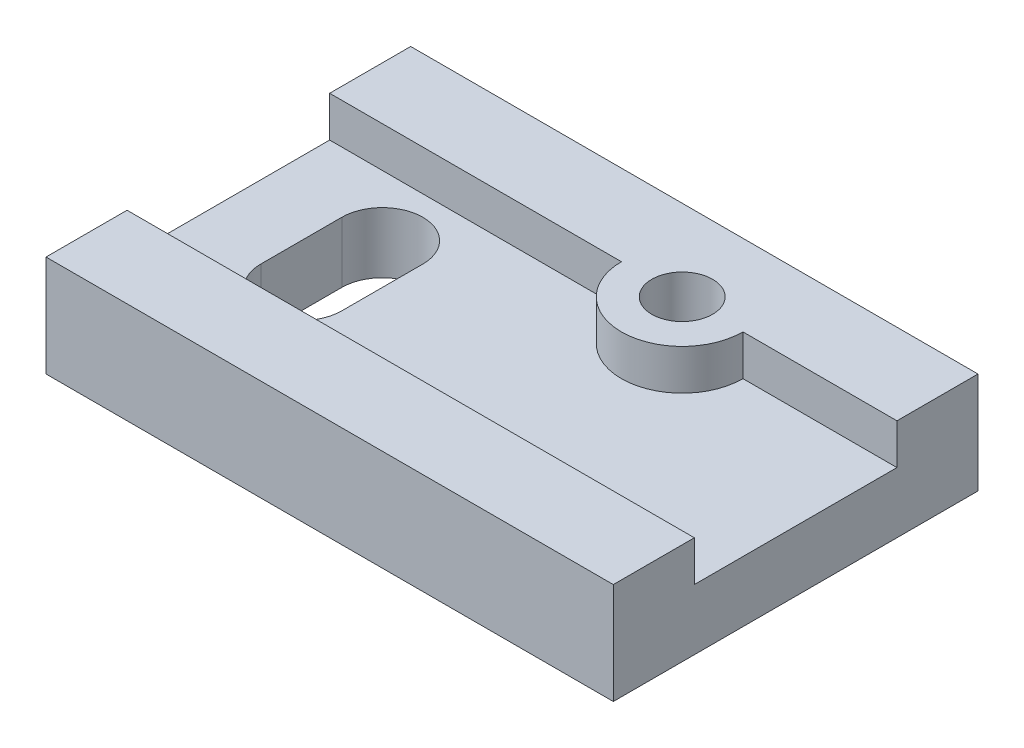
from build123d import *

# Parameters (mm, degrees)
SKETCH_1_W          = 140
SKETCH_1_H          = 90
EXTRUDE_1_DEPTH     = 25
CUT_EXTRUDE_1_DEPTH = 10
SKETCH_3_R          = 7.5
CUT_EXTRUDE_2_DEPTH = 169.300326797
CUT_EXTRUDE_3_DEPTH = 168.107749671


with BuildPart() as part:
    # Sketch 1 → Extrude 1 (new body)
    with BuildSketch(Plane(origin=(0, 0, 0), x_dir=(1, 0, 0), z_dir=(0, 1, 0))):
        with Locations((-70, -45)):
            Rectangle(SKETCH_1_W, SKETCH_1_H)
    extrude(amount=EXTRUDE_1_DEPTH)

    # Sketch 2 → Cut-Extrude 1 (cut)
    with BuildSketch(Plane(origin=(0, 25, 0), x_dir=(1, 0, 0), z_dir=(0, 1, 0))):
        with BuildLine():
            Line((-140, -20), (-68, -20))
            ThreePointArc((-68, -20), (-53, -35), (-38, -20))
            Line((-38, -20), (0, -20))
            Line((0, -20), (0, -70))
            Line((0, -70), (-140, -70))
            Line((-140, -70), (-140, -20))
        make_face()
    extrude(amount=-CUT_EXTRUDE_1_DEPTH, mode=Mode.SUBTRACT)

    # Sketch 3 → Cut-Extrude 2 (cut, through all)
    with BuildSketch(Plane(origin=(0, 25, 0), x_dir=(1, 0, 0), z_dir=(0, 1, 0))):
        with Locations(Location((-53, -20, 0), (0, 0, 270))):
            Circle(SKETCH_3_R)
    extrude(amount=-CUT_EXTRUDE_2_DEPTH, mode=Mode.SUBTRACT)

    # Sketch 4 → Cut-Extrude 3 (cut, through all)
    with BuildSketch(Plane(origin=(0, 15, 0), x_dir=(1, 0, 0), z_dir=(0, 1, 0))):
        with BuildLine():
            Line((-122, -35), (-122, -55))
            ThreePointArc((-122, -55), (-112, -65), (-102, -55))
            Line((-102, -55), (-102, -35))
            ThreePointArc((-102, -35), (-112, -25), (-122, -35))
        make_face()
    extrude(amount=-CUT_EXTRUDE_3_DEPTH, mode=Mode.SUBTRACT)


solid = part.part
